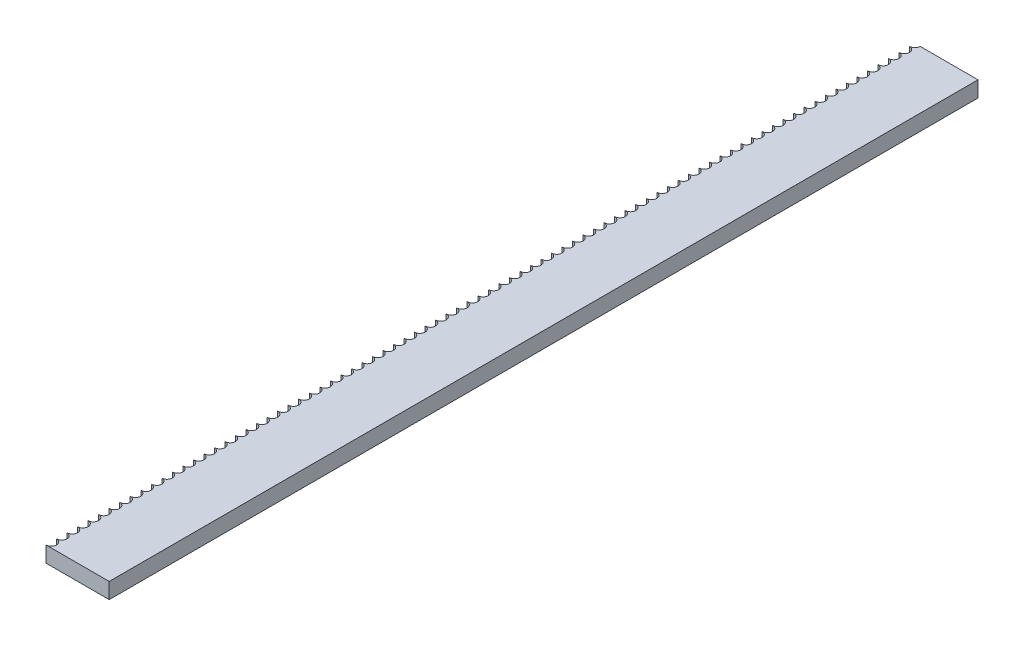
from build123d import *

# Parameters (mm, degrees)
SKETCH1_W           = 12
SKETCH1_H           = 165
BOSS_EXTRUDE1_DEPTH = 3
CUT_EXTRUDE1_DEPTH  = 83.772277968
LPATTERN1_COUNT     = 100
LPATTERN1_PITCH     = 2


with BuildPart() as part:
    # Sketch1 → Boss-Extrude1 (new body)
    with BuildSketch(Plane(origin=(0, 0, 0), x_dir=(1, 0, 0), z_dir=(0, 1, 0))):
        Rectangle(SKETCH1_W, SKETCH1_H)
    extrude(amount=BOSS_EXTRUDE1_DEPTH)

    # Sketch2 → Cut-Extrude1 (cut, symmetric)
    with BuildSketch(Plane(origin=(0, 3, 0), x_dir=(1, 0, 0), z_dir=(0, 1, 0))):
        with BuildLine():
            Line((-346.871576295, -82.5), (-6, -82.5))
            ThreePointArc((-6, -82.5), (-5, -81.5), (-6, -80.5))
            Line((-6, -80.5), (-346.871576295, -80.5))
            Line((-346.871576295, -80.5), (-1028.614728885, -80.5))
            Line((-1028.614728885, -80.5), (-1028.614728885, -82.5))
            Line((-1028.614728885, -82.5), (-346.871576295, -82.5))
        make_face()
    cut_extrude1 = extrude(amount=CUT_EXTRUDE1_DEPTH, both=True, mode=Mode.SUBTRACT)

    # LPattern1: Cut-Extrude1 ×100
    with Locations(*[(0, 0, -i * LPATTERN1_PITCH) for i in range(1, LPATTERN1_COUNT)]):
        add(cut_extrude1, mode=Mode.SUBTRACT)


solid = part.part
